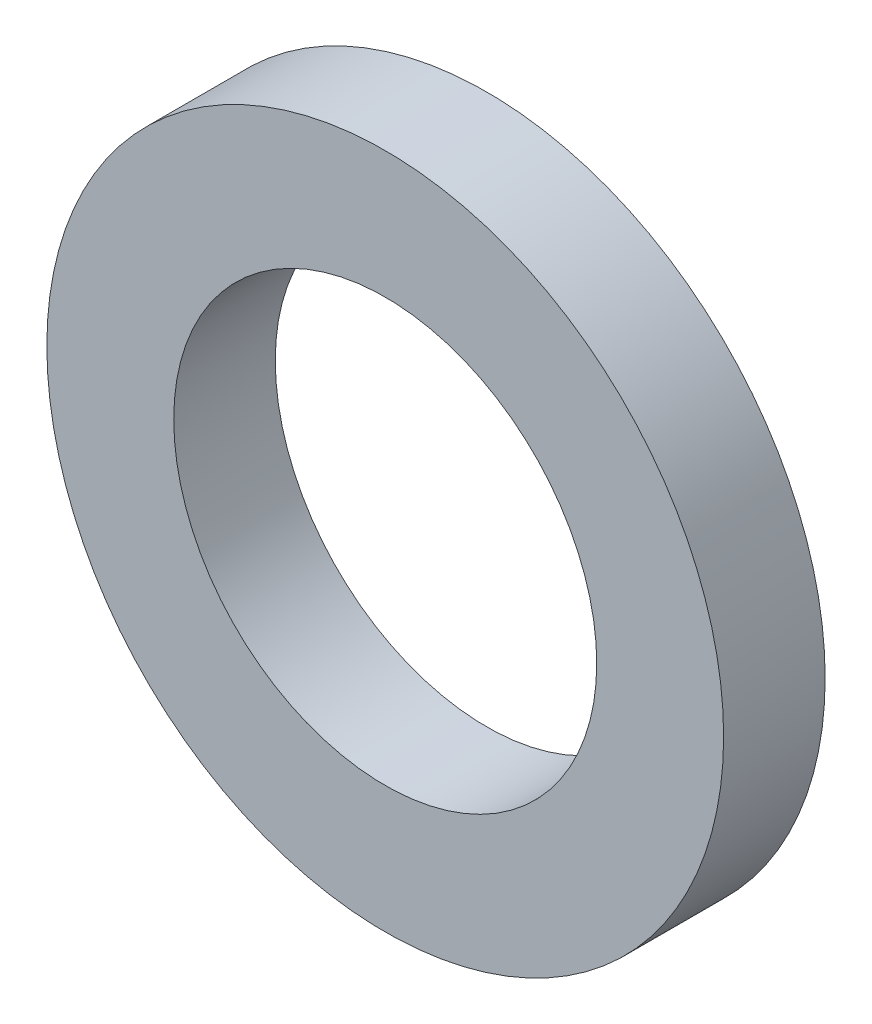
ISO-10303-21;
HEADER;
FILE_DESCRIPTION(('STEP AP214'),'2;1');
FILE_NAME('part.step','',(''),(''),'','','');
FILE_SCHEMA(('AUTOMOTIVE_DESIGN { 1 0 10303 214 1 1 1 1 }'));
ENDSEC;
DATA;
#1=APPLICATION_CONTEXT('core data for automotive mechanical design processes');
#2=APPLICATION_PROTOCOL_DEFINITION('international standard','automotive_design',2000,#1);
#3=PRODUCT_CONTEXT('',#1,'mechanical');
#4=PRODUCT('Part','Part','',(#3));
#5=PRODUCT_RELATED_PRODUCT_CATEGORY('part','',(#4));
#6=PRODUCT_DEFINITION_FORMATION('','',#4);
#7=PRODUCT_DEFINITION_CONTEXT('part definition',#1,'design');
#8=PRODUCT_DEFINITION('design','',#6,#7);
#9=PRODUCT_DEFINITION_SHAPE('','',#8);
#10=(LENGTH_UNIT() NAMED_UNIT(*) SI_UNIT(.MILLI.,.METRE.));
#11=(NAMED_UNIT(*) PLANE_ANGLE_UNIT() SI_UNIT($,.RADIAN.));
#12=(NAMED_UNIT(*) SI_UNIT($,.STERADIAN.) SOLID_ANGLE_UNIT());
#13=UNCERTAINTY_MEASURE_WITH_UNIT(LENGTH_MEASURE(1.E-05),#10,'distance_accuracy_value','');
#14=(GEOMETRIC_REPRESENTATION_CONTEXT(3) GLOBAL_UNCERTAINTY_ASSIGNED_CONTEXT((#13)) GLOBAL_UNIT_ASSIGNED_CONTEXT((#10,
#11,#12)) REPRESENTATION_CONTEXT('',''));
#15=CARTESIAN_POINT('',(0.,0.,0.));
#16=DIRECTION('',(0.,0.,1.));
#17=DIRECTION('',(1.,0.,0.));
#18=AXIS2_PLACEMENT_3D('',#15,#16,#17);
#19=CARTESIAN_POINT('',(0.,0.,1.8));
#20=DIRECTION('',(0.,0.,1.));
#21=DIRECTION('',(1.,0.,0.));
#22=AXIS2_PLACEMENT_3D('',#19,#20,#21);
#23=PLANE('',#22);
#24=CARTESIAN_POINT('',(0.,0.,1.8));
#25=DIRECTION('',(0.,0.,1.));
#26=DIRECTION('',(1.,0.,0.));
#27=AXIS2_PLACEMENT_3D('',#24,#25,#26);
#28=CIRCLE('',#27,6.);
#29=CARTESIAN_POINT('',(6.,0.,1.8));
#30=VERTEX_POINT('',#29);
#31=EDGE_CURVE('E10',#30,#30,#28,.T.);
#32=ORIENTED_EDGE('',*,*,#31,.T.);
#33=EDGE_LOOP('',(#32));
#34=FACE_BOUND('',#33,.T.);
#35=CARTESIAN_POINT('',(0.,0.,1.8));
#36=DIRECTION('',(0.,0.,1.));
#37=DIRECTION('',(1.,0.,0.));
#38=AXIS2_PLACEMENT_3D('',#35,#36,#37);
#39=CIRCLE('',#38,3.75);
#40=CARTESIAN_POINT('',(3.75,0.,1.8));
#41=VERTEX_POINT('',#40);
#42=EDGE_CURVE('E42',#41,#41,#39,.T.);
#43=ORIENTED_EDGE('',*,*,#42,.F.);
#44=EDGE_LOOP('',(#43));
#45=FACE_BOUND('',#44,.T.);
#46=ADVANCED_FACE('F31',(#34,#45),#23,.T.);
#47=CARTESIAN_POINT('',(0.,0.,0.));
#48=DIRECTION('',(0.,0.,1.));
#49=DIRECTION('',(1.,0.,0.));
#50=AXIS2_PLACEMENT_3D('',#47,#48,#49);
#51=PLANE('',#50);
#52=CARTESIAN_POINT('',(0.,0.,0.));
#53=DIRECTION('',(0.,0.,1.));
#54=DIRECTION('',(1.,0.,0.));
#55=AXIS2_PLACEMENT_3D('',#52,#53,#54);
#56=CIRCLE('',#55,6.);
#57=CARTESIAN_POINT('',(6.,0.,0.));
#58=VERTEX_POINT('',#57);
#59=EDGE_CURVE('E35',#58,#58,#56,.T.);
#60=ORIENTED_EDGE('',*,*,#59,.F.);
#61=EDGE_LOOP('',(#60));
#62=FACE_BOUND('',#61,.T.);
#63=CARTESIAN_POINT('',(0.,0.,0.));
#64=DIRECTION('',(0.,0.,1.));
#65=DIRECTION('',(1.,0.,0.));
#66=AXIS2_PLACEMENT_3D('',#63,#64,#65);
#67=CIRCLE('',#66,3.75);
#68=CARTESIAN_POINT('',(3.75,0.,0.));
#69=VERTEX_POINT('',#68);
#70=EDGE_CURVE('E44',#69,#69,#67,.T.);
#71=ORIENTED_EDGE('',*,*,#70,.T.);
#72=EDGE_LOOP('',(#71));
#73=FACE_BOUND('',#72,.T.);
#74=ADVANCED_FACE('F54',(#62,#73),#51,.F.);
#75=CARTESIAN_POINT('',(0.,0.,1.8));
#76=DIRECTION('',(0.,0.,-1.));
#77=DIRECTION('',(-1.,0.,0.));
#78=AXIS2_PLACEMENT_3D('',#75,#76,#77);
#79=CYLINDRICAL_SURFACE('',#78,6.);
#80=ORIENTED_EDGE('',*,*,#31,.F.);
#81=EDGE_LOOP('',(#80));
#82=FACE_BOUND('',#81,.T.);
#83=ORIENTED_EDGE('',*,*,#59,.T.);
#84=EDGE_LOOP('',(#83));
#85=FACE_BOUND('',#84,.T.);
#86=ADVANCED_FACE('F33',(#82,#85),#79,.T.);
#87=CARTESIAN_POINT('',(0.,0.,1.8));
#88=DIRECTION('',(0.,0.,-1.));
#89=DIRECTION('',(-1.,0.,0.));
#90=AXIS2_PLACEMENT_3D('',#87,#88,#89);
#91=CYLINDRICAL_SURFACE('',#90,3.75);
#92=ORIENTED_EDGE('',*,*,#42,.T.);
#93=EDGE_LOOP('',(#92));
#94=FACE_BOUND('',#93,.T.);
#95=ORIENTED_EDGE('',*,*,#70,.F.);
#96=EDGE_LOOP('',(#95));
#97=FACE_BOUND('',#96,.T.);
#98=ADVANCED_FACE('F50',(#94,#97),#91,.F.);
#99=CLOSED_SHELL('',(#46,#74,#86,#98));
#100=MANIFOLD_SOLID_BREP('B2',#99);
#101=ADVANCED_BREP_SHAPE_REPRESENTATION('',(#18,#100),#14);
#102=SHAPE_DEFINITION_REPRESENTATION(#9,#101);
ENDSEC;
END-ISO-10303-21;
